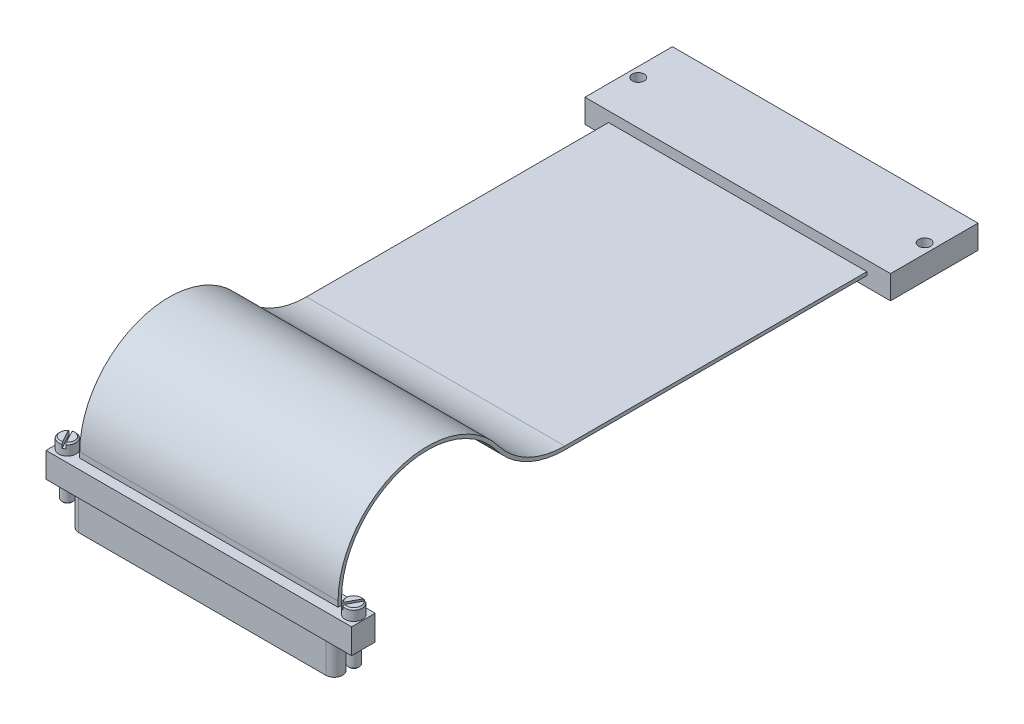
from build123d import *

# Parameters (mm, degrees)
BASE_EXTRUDE_DEPTH       = 1.0795
BASE_EXTRUDE_DEPTH_BACK  = 1.0795
SKETCH1_W                = 27.94
SKETCH1_H                = 2.286
BOSS_EXTRUDE1_DEPTH      = 3.048
SKETCH4_R                = 0.127
CUT_EXTRUDE2_DEPTH       = 3.048
CUT_EXTRUDE5_DEPTH       = 0.5
BOSS_EXTRUDE2_DEPTH      = 11.81
BOSS_EXTRUDE2_DEPTH_BACK = 11.81
BOSS_EXTRUDE3_DEPTH      = 13.97
BOSS_EXTRUDE3_DEPTH_BACK = 13.97
SKETCH6_W                = 8
SKETCH6_H                = 2.159
SKETCH7_R                = 0.55
CUT_EXTRUDE3_DEPTH       = 59.550697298
SKETCH3_R                = 0.7874
BOSS_EXTRUDE4_DEPTH      = 1.016
CUT_EXTRUDE4_START       = -0.4445
CUT_EXTRUDE4_DEPTH       = 0.4445
CHAMFER5_SIZE            = 0.127
SKETCH9_R                = 0.50038
BOSS_EXTRUDE5_DEPTH      = 4
CHAMFER6_SIZE            = 0.1


with BuildPart() as part:
    # Sketch1 → Base-Extrude (new, two sides: drawn at the far end of the back side and taken through both)
    with BuildSketch(Plane.XY.offset(-BASE_EXTRUDE_DEPTH_BACK)):
        with Locations((0, -1.143)):
            Rectangle(SKETCH1_W, SKETCH1_H)
    extrude(amount=BASE_EXTRUDE_DEPTH + BASE_EXTRUDE_DEPTH_BACK)

    # Sketch2 → Boss-Extrude1 (add)
    with BuildSketch(Plane.XZ.offset(2.286)):
        with BuildLine():
            Line((11.303, 0.762), (-11.303, 0.762))
            ThreePointArc((-11.303, 0.762), (-12.065, 0), (-11.303, -0.762))
            Line((-11.303, -0.762), (11.303, -0.762))
            ThreePointArc((11.303, -0.762), (12.065, 0), (11.303, 0.762))
        make_face()
    extrude(amount=BOSS_EXTRUDE1_DEPTH)

    # Sketch4 → Cut-Extrude2 (cut)
    with BuildSketch(Plane.XZ.offset(5.334)):
        with BuildLine():
            Line((11.303, -0.635), (-11.303, -0.635))
            ThreePointArc((-11.303, -0.635), (-11.938, 0), (-11.303, 0.635))
            Line((-11.303, 0.635), (11.303, 0.635))
            ThreePointArc((11.303, 0.635), (11.938, 0), (11.303, -0.635))
        make_face()
        Circle(SKETCH4_R, mode=Mode.SUBTRACT)
        with Locations((1.87325, 0)):
            Circle(SKETCH4_R, mode=Mode.SUBTRACT)
        with Locations((3.7465, 0)):
            Circle(SKETCH4_R, mode=Mode.SUBTRACT)
        with Locations((5.61975, 0)):
            Circle(SKETCH4_R, mode=Mode.SUBTRACT)
        with Locations((7.493, 0)):
            Circle(SKETCH4_R, mode=Mode.SUBTRACT)
        with Locations(Location((-5.61975, 0, 0), (0, 0, 180))):
            Circle(SKETCH4_R, mode=Mode.SUBTRACT)
        with Locations(Location((-3.7465, 0, 0), (0, 0, 180))):
            Circle(SKETCH4_R, mode=Mode.SUBTRACT)
        with Locations(Location((-1.87325, 0, 0), (0, 0, 180))):
            Circle(SKETCH4_R, mode=Mode.SUBTRACT)
        with Locations(Location((9.36625, 0, 0), (0, 0, 180))):
            Circle(SKETCH4_R, mode=Mode.SUBTRACT)
        with Locations(Location((11.2395, 0, 0), (0, 0, 180))):
            Circle(SKETCH4_R, mode=Mode.SUBTRACT)
        with Locations((-11.2395, 0)):
            Circle(SKETCH4_R, mode=Mode.SUBTRACT)
        with Locations((-9.36625, 0)):
            Circle(SKETCH4_R, mode=Mode.SUBTRACT)
        with Locations(Location((-7.493, 0, 0), (0, 0, 180))):
            Circle(SKETCH4_R, mode=Mode.SUBTRACT)
    extrude(amount=-CUT_EXTRUDE2_DEPTH, mode=Mode.SUBTRACT)

    # Sketch10 → Cut-Extrude5 (cut)
    with BuildSketch(Plane.XZ.offset(5.334)):
        with BuildLine():
            Line((11.303, -0.635), (-11.303, -0.635))
            ThreePointArc((-11.303, -0.635), (-11.938, 0), (-11.303, 0.635))
            Line((-11.303, 0.635), (11.303, 0.635))
            ThreePointArc((11.303, 0.635), (11.938, 0), (11.303, -0.635))
        make_face()
    extrude(amount=-CUT_EXTRUDE5_DEPTH, mode=Mode.SUBTRACT)

    # Sketch5 → Boss-Extrude2 (add, two sides: drawn at the far end of the back side and taken through both)
    with BuildSketch(Plane(origin=(0, 0, 0), x_dir=(0, 0, -1), z_dir=(1, 0, 0)).offset(-BOSS_EXTRUDE2_DEPTH_BACK)):
        with BuildLine():
            Line((-0.155, 0), (-0.155, 0.5))
            ThreePointArc((-0.155, 0.5), (5.424764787, 8.249241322), (14.543504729, 5.414969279))
            ThreePointArc((14.543504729, 5.414969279), (17.205200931, 3.199986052), (20.575714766, 2.406))
            Line((20.575714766, 2.406), (48.195714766, 2.406))
            Line((48.195714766, 2.406), (48.195714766, 2.096))
            Line((48.195714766, 2.096), (20.575714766, 2.096))
            ThreePointArc((20.575714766, 2.096), (17.0668273, 2.922582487), (14.295857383, 5.2285))
            ThreePointArc((14.295857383, 5.2285), (5.523073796, 7.955242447), (0.155, 0.5))
            Line((0.155, 0.5), (0.155, 0))
            Line((0.155, 0), (-0.155, 0))
        make_face()
    extrude(amount=BOSS_EXTRUDE2_DEPTH + BOSS_EXTRUDE2_DEPTH_BACK)

    # Sketch6 → Boss-Extrude3 (add, two sides: drawn at the far end of the back side and taken through both)
    with BuildSketch(Plane(origin=(0, 0, 0), x_dir=(0, 0, -1), z_dir=(1, 0, 0)).offset(-BOSS_EXTRUDE3_DEPTH_BACK)):
        with Locations((52.195714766, 2.2505)):
            Rectangle(SKETCH6_W, SKETCH6_H)
    extrude(amount=BOSS_EXTRUDE3_DEPTH + BOSS_EXTRUDE3_DEPTH_BACK)

    # Sketch7 → Cut-Extrude3 (cut, through all)
    with BuildSketch(Plane(origin=(0, 3.33, 0), x_dir=(-1, 0, 0), z_dir=(0, 1, 0))):
        with Locations(Location((-13.0935, -52.195714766, 0), (0, 0, 90))):
            Circle(SKETCH7_R)
        with Locations(Location((13.0935, -52.195714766, 0), (0, 0, 90))):
            Circle(SKETCH7_R)
    extrude(amount=-CUT_EXTRUDE3_DEPTH, mode=Mode.SUBTRACT)

    # Sketch3 → Boss-Extrude4 (add)
    with BuildSketch(Plane(origin=(0, 0, 0), x_dir=(-1, 0, 0), z_dir=(0, 1, 0))):
        with Locations((-13.0935, 0)):
            Circle(SKETCH3_R)
        with Locations(Location((13.0935, 0, 0), (0, 0, 180))):
            Circle(SKETCH3_R)
    extrude(amount=BOSS_EXTRUDE4_DEPTH)

    # Sketch8 → Cut-Extrude4 (cut)
    with BuildSketch(Plane(origin=(0, 1.016, 0), x_dir=(-1, 0, 0), z_dir=(0, 1, 0)).offset(CUT_EXTRUDE4_START)):
        with BuildLine():
            Line((12.836706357, 0.744349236), (13.57068477, -0.626333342))
            ThreePointArc((13.57068477, -0.626333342), (13.465202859, -0.694143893), (13.350293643, -0.744349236))
            Line((13.350293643, -0.744349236), (12.61631523, 0.626333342))
            ThreePointArc((12.61631523, 0.626333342), (12.721797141, 0.694143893), (12.836706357, 0.744349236))
        make_face()
        with BuildLine():
            Line((-12.61631523, 0.626333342), (-13.350293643, -0.744349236))
            ThreePointArc((-13.350293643, -0.744349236), (-13.465202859, -0.694143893), (-13.57068477, -0.626333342))
            Line((-13.57068477, -0.626333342), (-12.836706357, 0.744349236))
            ThreePointArc((-12.836706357, 0.744349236), (-12.721797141, 0.694143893), (-12.61631523, 0.626333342))
        make_face()
    extrude(amount=CUT_EXTRUDE4_DEPTH, mode=Mode.SUBTRACT)

    # Chamfer5
    chamfer5_edges = [part.edges().sort_by_distance(p)[0] for p in [
        (-13.787643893, 1.016, 0.371702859),
        (-12.636444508, 1.016, -0.641170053),
        (13.787643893, 1.016, 0.371702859),
        (12.636444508, 1.016, -0.641170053),
    ]]
    chamfer(chamfer5_edges, length=CHAMFER5_SIZE)

    # Sketch9 → Boss-Extrude5 (add)
    with BuildSketch(Plane(origin=(0, 0, 0), x_dir=(-1, 0, 0), z_dir=(0, 1, 0))):
        with Locations((-13.0935, 0)):
            Circle(SKETCH9_R)
        with Locations((13.0935, 0)):
            Circle(SKETCH9_R)
    extrude(amount=-BOSS_EXTRUDE5_DEPTH)

    # Chamfer6
    chamfer6_edges = [part.edges().sort_by_distance(p)[0] for p in [
        (13.59388, -4, 0),
        (-12.59312, -4, 0),
    ]]
    chamfer(chamfer6_edges, length=CHAMFER6_SIZE)


solid = part.part
